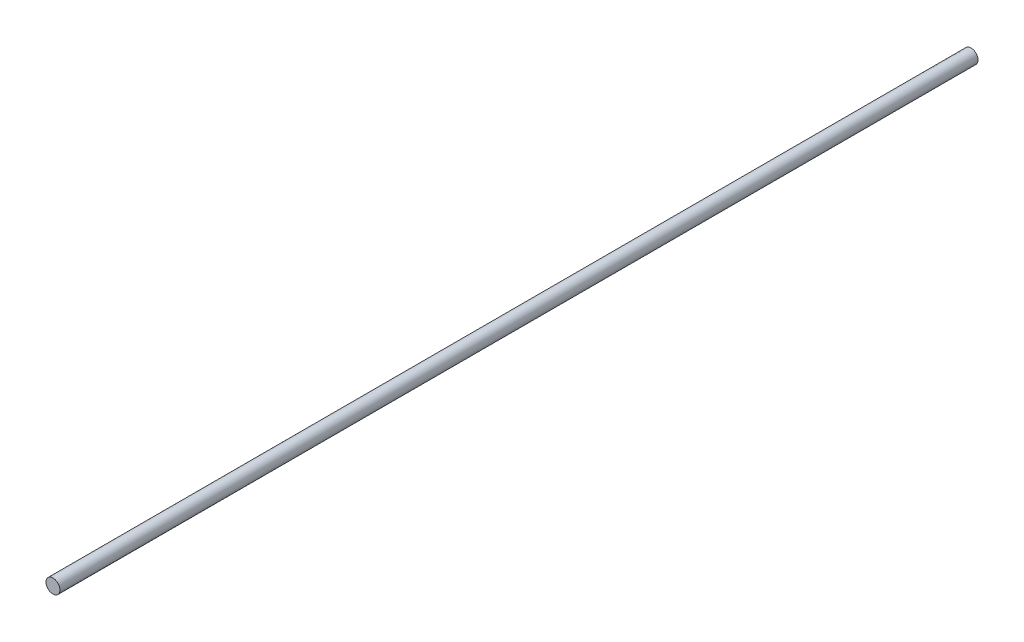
from build123d import *

# Parameters (mm, degrees)
SKETCH1_R           = 30
BOSS_EXTRUDE1_DEPTH = 3950


with BuildPart() as part:
    # Sketch1 → Boss-Extrude1 (new body)
    with BuildSketch(Plane.XY):
        Circle(SKETCH1_R)
    extrude(amount=-BOSS_EXTRUDE1_DEPTH)


solid = part.part
